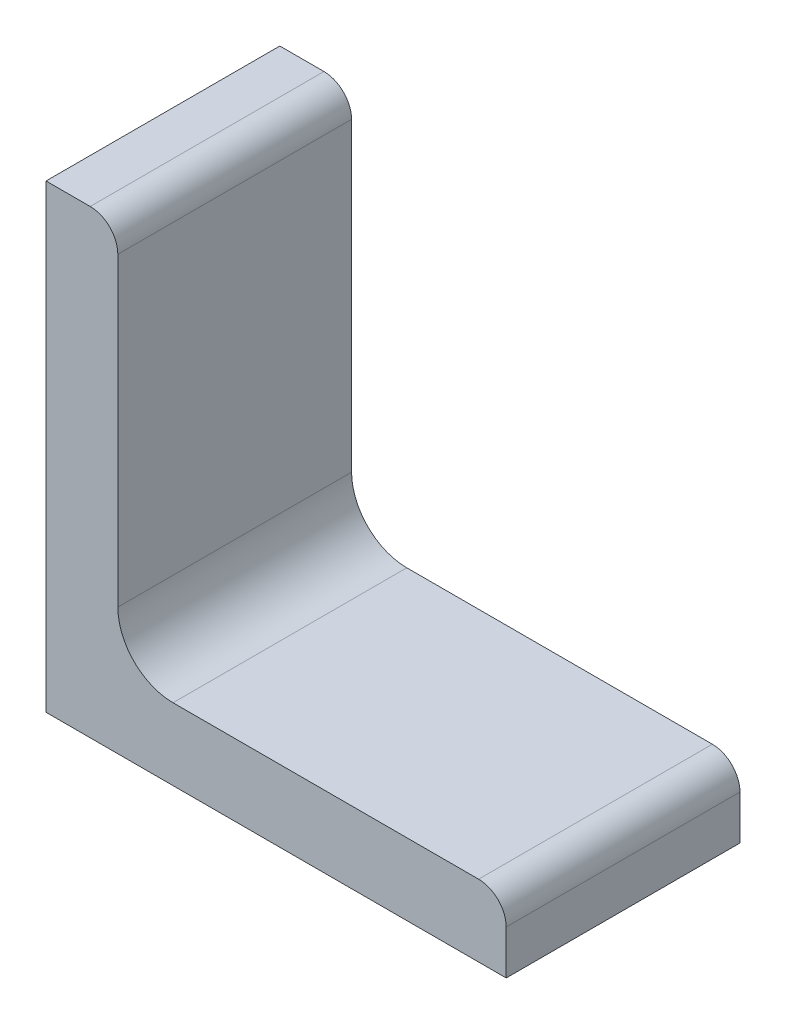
from build123d import *

# Parameters (mm, degrees)
BASESECTION_DEPTH = 12.7


with BuildPart() as part:
    # Sketch1 → BaseSection (new, symmetric)
    with BuildSketch(Plane.XY):
        with BuildLine():
            Line((0, 0), (50, 0))
            Line((50, 0), (50, 4.8))
            ThreePointArc((50, 4.8), (49.121320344, 6.921320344), (47, 7.8))
            Line((47, 7.8), (13.8, 7.8))
            ThreePointArc((13.8, 7.8), (9.557359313, 9.557359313), (7.8, 13.8))
            Line((7.8, 13.8), (7.8, 47))
            ThreePointArc((7.8, 47), (6.921320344, 49.121320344), (4.8, 50))
            Line((4.8, 50), (0, 50))
            Line((0, 50), (0, 0))
        make_face()
    extrude(amount=BASESECTION_DEPTH, both=True)


solid = part.part
